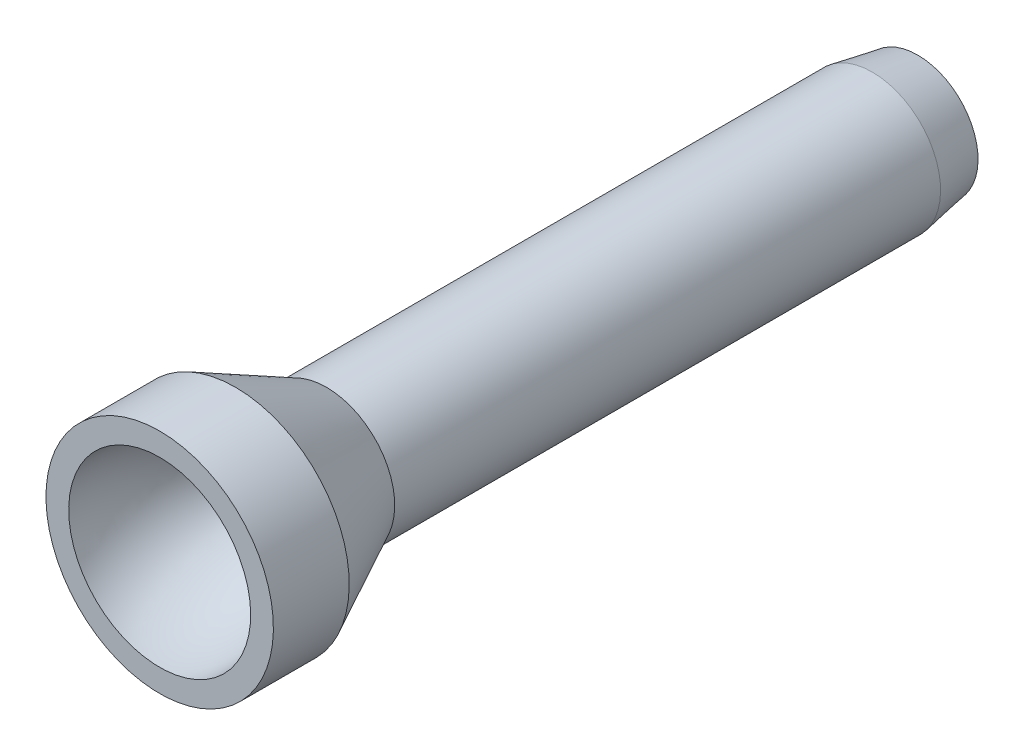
ISO-10303-21;
HEADER;
FILE_DESCRIPTION(('STEP AP214'),'2;1');
FILE_NAME('part.step','',(''),(''),'','','');
FILE_SCHEMA(('AUTOMOTIVE_DESIGN { 1 0 10303 214 1 1 1 1 }'));
ENDSEC;
DATA;
#1=APPLICATION_CONTEXT('core data for automotive mechanical design processes');
#2=APPLICATION_PROTOCOL_DEFINITION('international standard','automotive_design',2000,#1);
#3=PRODUCT_CONTEXT('',#1,'mechanical');
#4=PRODUCT('Part','Part','',(#3));
#5=PRODUCT_RELATED_PRODUCT_CATEGORY('part','',(#4));
#6=PRODUCT_DEFINITION_FORMATION('','',#4);
#7=PRODUCT_DEFINITION_CONTEXT('part definition',#1,'design');
#8=PRODUCT_DEFINITION('design','',#6,#7);
#9=PRODUCT_DEFINITION_SHAPE('','',#8);
#10=(LENGTH_UNIT() NAMED_UNIT(*) SI_UNIT(.MILLI.,.METRE.));
#11=(NAMED_UNIT(*) PLANE_ANGLE_UNIT() SI_UNIT($,.RADIAN.));
#12=(NAMED_UNIT(*) SI_UNIT($,.STERADIAN.) SOLID_ANGLE_UNIT());
#13=UNCERTAINTY_MEASURE_WITH_UNIT(LENGTH_MEASURE(1.E-05),#10,'distance_accuracy_value','');
#14=(GEOMETRIC_REPRESENTATION_CONTEXT(3) GLOBAL_UNCERTAINTY_ASSIGNED_CONTEXT((#13)) GLOBAL_UNIT_ASSIGNED_CONTEXT((#10,
#11,#12)) REPRESENTATION_CONTEXT('',''));
#15=CARTESIAN_POINT('',(0.,0.,0.));
#16=DIRECTION('',(0.,0.,1.));
#17=DIRECTION('',(1.,0.,0.));
#18=AXIS2_PLACEMENT_3D('',#15,#16,#17);
#19=CARTESIAN_POINT('',(0.,19.05,0.));
#20=DIRECTION('',(0.,0.,1.));
#21=DIRECTION('',(0.,-1.,0.));
#22=AXIS2_PLACEMENT_3D('',#19,#20,#21);
#23=PLANE('',#22);
#24=CARTESIAN_POINT('',(0.,0.,0.));
#25=DIRECTION('',(0.,0.,-1.));
#26=DIRECTION('',(0.,1.,0.));
#27=AXIS2_PLACEMENT_3D('',#24,#25,#26);
#28=CIRCLE('',#27,15.24);
#29=CARTESIAN_POINT('',(0.,15.24,0.));
#30=VERTEX_POINT('',#29);
#31=EDGE_CURVE('E48',#30,#30,#28,.T.);
#32=ORIENTED_EDGE('',*,*,#31,.T.);
#33=EDGE_LOOP('',(#32));
#34=FACE_BOUND('',#33,.T.);
#35=CARTESIAN_POINT('',(0.,0.,0.));
#36=DIRECTION('',(0.,0.,-1.));
#37=DIRECTION('',(0.,1.,0.));
#38=AXIS2_PLACEMENT_3D('',#35,#36,#37);
#39=CIRCLE('',#38,19.05);
#40=CARTESIAN_POINT('',(0.,19.05,0.));
#41=VERTEX_POINT('',#40);
#42=EDGE_CURVE('E58',#41,#41,#39,.T.);
#43=ORIENTED_EDGE('',*,*,#42,.F.);
#44=EDGE_LOOP('',(#43));
#45=FACE_BOUND('',#44,.T.);
#46=ADVANCED_FACE('F31',(#34,#45),#23,.T.);
#47=CARTESIAN_POINT('',(0.,0.,-163.71920683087));
#48=DIRECTION('',(0.,0.,-1.));
#49=DIRECTION('',(0.,1.,0.));
#50=AXIS2_PLACEMENT_3D('',#47,#48,#49);
#51=CYLINDRICAL_SURFACE('',#50,19.05);
#52=ORIENTED_EDGE('',*,*,#42,.T.);
#53=EDGE_LOOP('',(#52));
#54=FACE_BOUND('',#53,.T.);
#55=CARTESIAN_POINT('',(0.,0.,-12.7));
#56=DIRECTION('',(0.,0.,-1.));
#57=DIRECTION('',(0.,1.,0.));
#58=AXIS2_PLACEMENT_3D('',#55,#56,#57);
#59=CIRCLE('',#58,19.05);
#60=CARTESIAN_POINT('',(0.,19.05,-12.7));
#61=VERTEX_POINT('',#60);
#62=EDGE_CURVE('E53',#61,#61,#59,.T.);
#63=ORIENTED_EDGE('',*,*,#62,.F.);
#64=EDGE_LOOP('',(#63));
#65=FACE_BOUND('',#64,.T.);
#66=ADVANCED_FACE('F70',(#54,#65),#51,.T.);
#67=CARTESIAN_POINT('',(0.,0.,-27.94));
#68=DIRECTION('',(0.,0.,1.));
#69=DIRECTION('',(0.,-1.,0.));
#70=AXIS2_PLACEMENT_3D('',#67,#68,#69);
#71=CONICAL_SURFACE('',#70,11.43,0.463647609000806);
#72=ORIENTED_EDGE('',*,*,#62,.T.);
#73=EDGE_LOOP('',(#72));
#74=FACE_BOUND('',#73,.T.);
#75=CARTESIAN_POINT('',(0.,0.,-27.94));
#76=DIRECTION('',(0.,0.,-1.));
#77=DIRECTION('',(0.,1.,0.));
#78=AXIS2_PLACEMENT_3D('',#75,#76,#77);
#79=CIRCLE('',#78,11.43);
#80=CARTESIAN_POINT('',(0.,11.43,-27.94));
#81=VERTEX_POINT('',#80);
#82=EDGE_CURVE('E50',#81,#81,#79,.T.);
#83=ORIENTED_EDGE('',*,*,#82,.F.);
#84=EDGE_LOOP('',(#83));
#85=FACE_BOUND('',#84,.T.);
#86=ADVANCED_FACE('F74',(#74,#85),#71,.T.);
#87=CARTESIAN_POINT('',(0.,0.,-163.71920683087));
#88=DIRECTION('',(0.,0.,-1.));
#89=DIRECTION('',(0.,1.,0.));
#90=AXIS2_PLACEMENT_3D('',#87,#88,#89);
#91=CYLINDRICAL_SURFACE('',#90,11.43);
#92=CARTESIAN_POINT('',(0.,0.,-119.38));
#93=DIRECTION('',(0.,0.,-1.));
#94=DIRECTION('',(0.,1.,0.));
#95=AXIS2_PLACEMENT_3D('',#92,#93,#94);
#96=CIRCLE('',#95,11.43);
#97=CARTESIAN_POINT('',(0.,11.43,-119.38));
#98=VERTEX_POINT('',#97);
#99=EDGE_CURVE('E11',#98,#98,#96,.F.);
#100=ORIENTED_EDGE('',*,*,#99,.T.);
#101=EDGE_LOOP('',(#100));
#102=FACE_BOUND('',#101,.T.);
#103=ORIENTED_EDGE('',*,*,#82,.T.);
#104=EDGE_LOOP('',(#103));
#105=FACE_BOUND('',#104,.T.);
#106=ADVANCED_FACE('F81',(#102,#105),#91,.T.);
#107=CARTESIAN_POINT('',(0.,11.43,-127.));
#108=DIRECTION('',(0.,0.,-1.));
#109=DIRECTION('',(0.,1.,0.));
#110=AXIS2_PLACEMENT_3D('',#107,#108,#109);
#111=PLANE('',#110);
#112=CARTESIAN_POINT('',(0.,0.,-127.));
#113=DIRECTION('',(0.,0.,-1.));
#114=DIRECTION('',(0.,1.,0.));
#115=AXIS2_PLACEMENT_3D('',#112,#113,#114);
#116=CIRCLE('',#115,10.0863884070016);
#117=CARTESIAN_POINT('',(0.,10.0863884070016,-127.));
#118=VERTEX_POINT('',#117);
#119=EDGE_CURVE('E38',#118,#118,#116,.T.);
#120=ORIENTED_EDGE('',*,*,#119,.T.);
#121=EDGE_LOOP('',(#120));
#122=FACE_BOUND('',#121,.T.);
#123=ADVANCED_FACE('F44',(#122),#111,.T.);
#124=CARTESIAN_POINT('',(0.,-13.5466666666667,0.));
#125=DIRECTION('',(-1.,0.,0.));
#126=DIRECTION('',(0.,1.,0.));
#127=AXIS2_PLACEMENT_3D('',#124,#125,#126);
#128=CIRCLE('',#127,28.7866666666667);
#129=TRIMMED_CURVE('',#128,(PARAMETER_VALUE(-1.08083900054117)),
(PARAMETER_VALUE(1.08083900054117)),.T.,.PARAMETER.);
#130=CARTESIAN_POINT('',(0.,0.,0.));
#131=DIRECTION('',(0.,0.,-1.));
#132=AXIS1_PLACEMENT('',#130,#131);
#133=SURFACE_OF_REVOLUTION('',#129,#132);
#134=CARTESIAN_POINT('',(0.,0.,-25.4));
#135=VERTEX_POINT('',#134);
#136=VERTEX_LOOP('',#135);
#137=FACE_BOUND('',#136,.T.);
#138=ORIENTED_EDGE('',*,*,#31,.F.);
#139=EDGE_LOOP('',(#138));
#140=FACE_BOUND('',#139,.T.);
#141=ADVANCED_FACE('F41',(#137,#140),#133,.F.);
#142=CARTESIAN_POINT('',(0.,0.,-127.));
#143=DIRECTION('',(0.,0.,1.));
#144=DIRECTION('',(0.,-1.,0.));
#145=AXIS2_PLACEMENT_3D('',#142,#143,#144);
#146=CONICAL_SURFACE('',#145,10.0863884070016,0.174532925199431);
#147=ORIENTED_EDGE('',*,*,#99,.F.);
#148=EDGE_LOOP('',(#147));
#149=FACE_BOUND('',#148,.T.);
#150=ORIENTED_EDGE('',*,*,#119,.F.);
#151=EDGE_LOOP('',(#150));
#152=FACE_BOUND('',#151,.T.);
#153=ADVANCED_FACE('F33',(#149,#152),#146,.T.);
#154=CLOSED_SHELL('',(#46,#66,#86,#106,#123,#141,#153));
#155=MANIFOLD_SOLID_BREP('B2',#154);
#156=ADVANCED_BREP_SHAPE_REPRESENTATION('',(#18,#155),#14);
#157=SHAPE_DEFINITION_REPRESENTATION(#9,#156);
ENDSEC;
END-ISO-10303-21;
